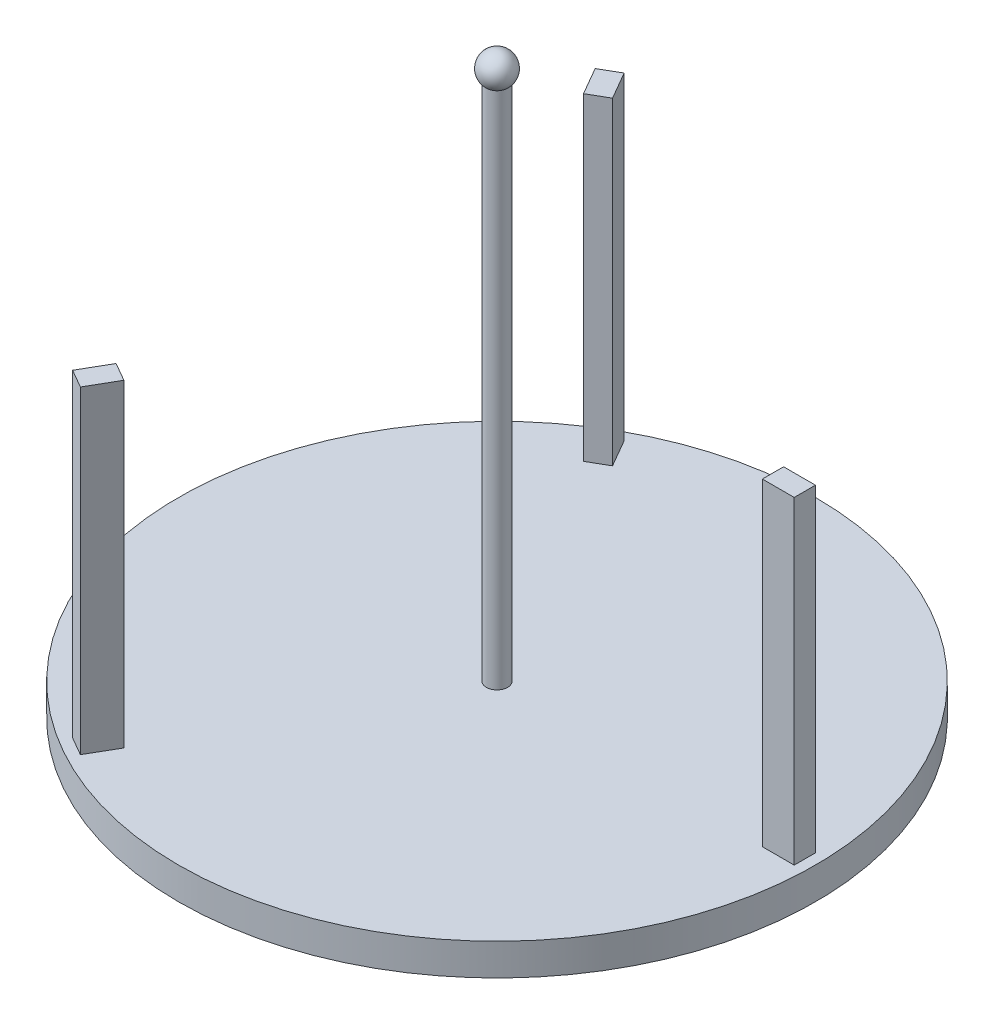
from build123d import *

# Parameters (mm, degrees)
SKETCH_1_W               = 300
SKETCH_1_H               = 30
SKETCH_3_W               = 30
SKETCH_3_H               = 20
EXTRUDE_1_DEPTH          = 300
PATTERN_CIRCULAR_1_COUNT = 3
SKETCH_4_R               = 10
EXTRUDE_2_DEPTH          = 500


with BuildPart() as part:
    # Sketch 1 → Revolve 1 (revolve)
    with BuildSketch(Plane.XY, mode=Mode.PRIVATE) as revolve_1_sk:
        with Locations((150, 15)):
            Rectangle(SKETCH_1_W, SKETCH_1_H)
    revolve(revolve_1_sk.sketch.rotate(Axis((0, -34.978212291, 0), (0, 1, 0)), 90), axis=Axis((0, -34.978212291, 0), (0, 1, 0)))

    # Sketch 3 → Extrude 1 (add)
    with BuildSketch(Plane(origin=(0, 30, 0), x_dir=(-1, 0, 0), z_dir=(0, 1, 0))):
        with Locations((-275, 0)):
            Rectangle(SKETCH_3_W, SKETCH_3_H)
    extrude_1 = extrude(amount=EXTRUDE_1_DEPTH)

    # Pattern Circular 1: Extrude 1 ×3 about axis
    pattern_circular_1_axis = Axis((0, 0, 0), (0, 1, 0))
    for i in range(1, PATTERN_CIRCULAR_1_COUNT):
        add(extrude_1.rotate(pattern_circular_1_axis, i * 360 / PATTERN_CIRCULAR_1_COUNT))

    # Sketch 4 → Extrude 2 (add)
    with BuildSketch(Plane(origin=(0, 30, 0), x_dir=(1, 0, 0), z_dir=(0, 1, 0))):
        with Locations(Location((0, 0, 0), (0, 0, 270))):
            Circle(SKETCH_4_R)
    extrude(amount=EXTRUDE_2_DEPTH)

    # Sketch 7 → Revolve 11 (revolve)
    with BuildSketch(Plane.XY):
        with BuildLine():
            Line((0, 515), (0, 545))
            ThreePointArc((0, 545), (-15, 530), (0, 515))
        make_face()
    revolve(axis=Axis((0, 396.738957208, 0), (0, 1, 0)))


solid = part.part
